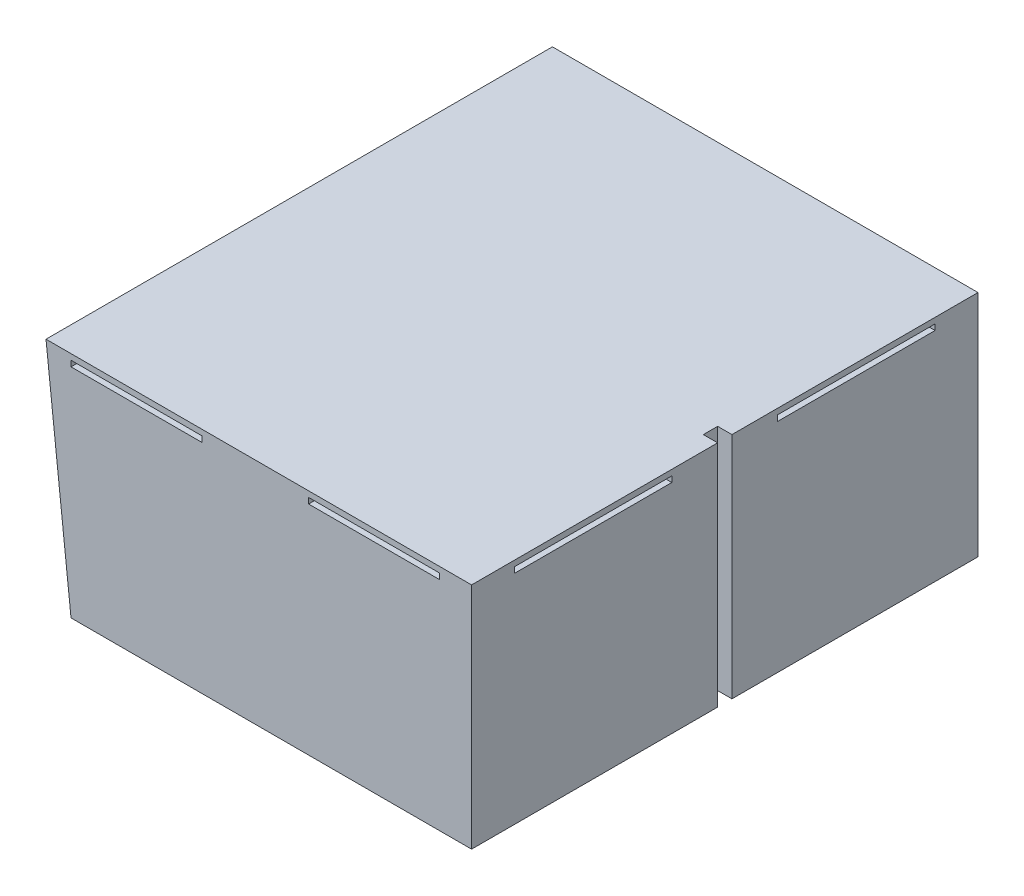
from build123d import *

# Parameters (mm, degrees)
BOSS_EXTRUDE1_DEPTH = 1770
SKETCH2_W           = 457.431779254
SKETCH2_H           = 20
CUT_EXTRUDE1_DEPTH  = 2395.347510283
SKETCH3_W           = 550
SKETCH3_H           = 20
CUT_EXTRUDE2_DEPTH  = 2447.523202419
SKETCH4_W           = 50
SKETCH4_H           = 800
CUT_EXTRUDE3_DEPTH  = 50


with BuildPart() as part:
    # Sketch1 → Boss-Extrude1 (new body)
    with BuildSketch(Plane.XY):
        Polygon((0, 0), (1400, 0), (1400, 800), (-87.472951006, 800), align=None)
    extrude(amount=BOSS_EXTRUDE1_DEPTH)

    # Sketch2 → Cut-Extrude1 (cut, through all)
    with BuildSketch(Plane.XY.offset(1770)):
        with Locations((228.715889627, 770)):
            Rectangle(SKETCH2_W, SKETCH2_H)
        with Locations((1059.019629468, 770)):
            Rectangle(SKETCH2_W, SKETCH2_H)
    extrude(amount=-CUT_EXTRUDE1_DEPTH, mode=Mode.SUBTRACT)

    # Sketch3 → Cut-Extrude2 (cut, through all)
    with BuildSketch(Plane(origin=(1400, 0, 0), x_dir=(0, 0, -1), z_dir=(1, 0, 0))):
        with Locations((-1345, 770)):
            Rectangle(SKETCH3_W, SKETCH3_H)
        with Locations((-425, 770)):
            Rectangle(SKETCH3_W, SKETCH3_H)
    extrude(amount=-CUT_EXTRUDE2_DEPTH, mode=Mode.SUBTRACT)

    # Sketch4 → Cut-Extrude3 (cut)
    with BuildSketch(Plane(origin=(1400, 0, 0), x_dir=(0, 0, -1), z_dir=(1, 0, 0))):
        with Locations((-885, 400)):
            Rectangle(SKETCH4_W, SKETCH4_H)
    extrude(amount=-CUT_EXTRUDE3_DEPTH, mode=Mode.SUBTRACT)


solid = part.part
